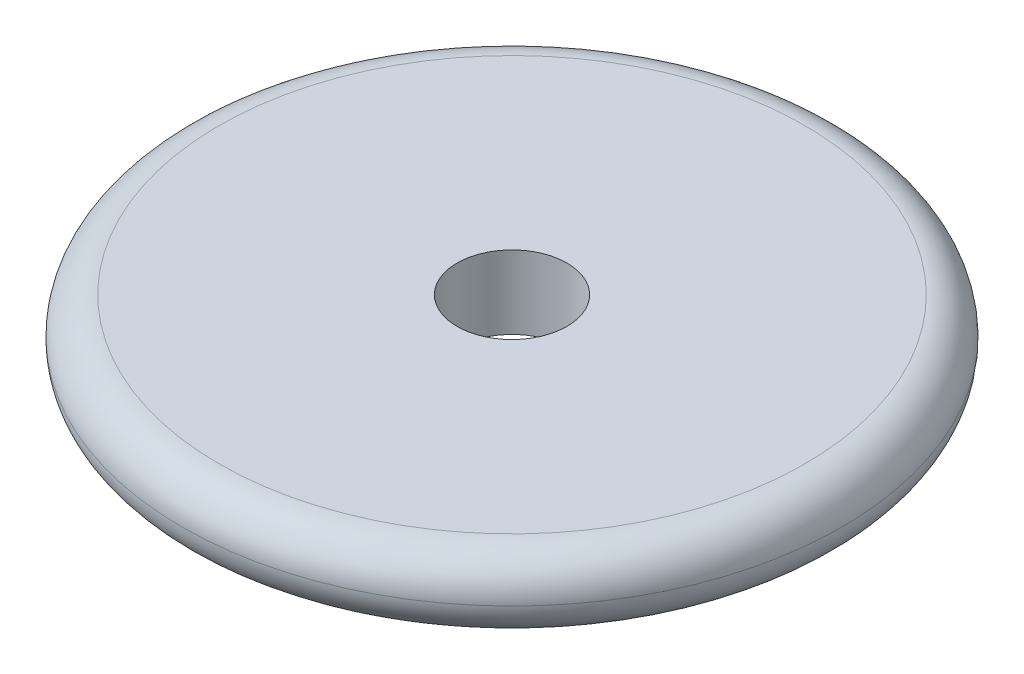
ISO-10303-21;
HEADER;
FILE_DESCRIPTION(('STEP AP214'),'2;1');
FILE_NAME('part.step','',(''),(''),'','','');
FILE_SCHEMA(('AUTOMOTIVE_DESIGN { 1 0 10303 214 1 1 1 1 }'));
ENDSEC;
DATA;
#1=APPLICATION_CONTEXT('core data for automotive mechanical design processes');
#2=APPLICATION_PROTOCOL_DEFINITION('international standard','automotive_design',2000,#1);
#3=PRODUCT_CONTEXT('',#1,'mechanical');
#4=PRODUCT('Part','Part','',(#3));
#5=PRODUCT_RELATED_PRODUCT_CATEGORY('part','',(#4));
#6=PRODUCT_DEFINITION_FORMATION('','',#4);
#7=PRODUCT_DEFINITION_CONTEXT('part definition',#1,'design');
#8=PRODUCT_DEFINITION('design','',#6,#7);
#9=PRODUCT_DEFINITION_SHAPE('','',#8);
#10=(LENGTH_UNIT() NAMED_UNIT(*) SI_UNIT(.MILLI.,.METRE.));
#11=(NAMED_UNIT(*) PLANE_ANGLE_UNIT() SI_UNIT($,.RADIAN.));
#12=(NAMED_UNIT(*) SI_UNIT($,.STERADIAN.) SOLID_ANGLE_UNIT());
#13=UNCERTAINTY_MEASURE_WITH_UNIT(LENGTH_MEASURE(1.E-05),#10,'distance_accuracy_value','');
#14=(GEOMETRIC_REPRESENTATION_CONTEXT(3) GLOBAL_UNCERTAINTY_ASSIGNED_CONTEXT((#13)) GLOBAL_UNIT_ASSIGNED_CONTEXT((#10,
#11,#12)) REPRESENTATION_CONTEXT('',''));
#15=CARTESIAN_POINT('',(0.,0.,0.));
#16=DIRECTION('',(0.,0.,1.));
#17=DIRECTION('',(1.,0.,0.));
#18=AXIS2_PLACEMENT_3D('',#15,#16,#17);
#19=CARTESIAN_POINT('',(0.,4.,0.));
#20=DIRECTION('',(0.,1.,0.));
#21=DIRECTION('',(0.,0.,1.));
#22=AXIS2_PLACEMENT_3D('',#19,#20,#21);
#23=PLANE('',#22);
#24=CARTESIAN_POINT('',(0.,4.,0.));
#25=DIRECTION('',(0.,-1.,0.));
#26=DIRECTION('',(0.,0.,-1.));
#27=AXIS2_PLACEMENT_3D('',#24,#25,#26);
#28=CIRCLE('',#27,3.);
#29=CARTESIAN_POINT('',(0.,4.,-3.));
#30=VERTEX_POINT('',#29);
#31=EDGE_CURVE('E59',#30,#30,#28,.T.);
#32=ORIENTED_EDGE('',*,*,#31,.T.);
#33=EDGE_LOOP('',(#32));
#34=FACE_BOUND('',#33,.T.);
#35=CARTESIAN_POINT('',(0.,4.,0.));
#36=DIRECTION('',(0.,1.,0.));
#37=DIRECTION('',(0.,0.,1.));
#38=AXIS2_PLACEMENT_3D('',#35,#36,#37);
#39=CIRCLE('',#38,16.);
#40=CARTESIAN_POINT('',(0.,4.,16.));
#41=VERTEX_POINT('',#40);
#42=EDGE_CURVE('E12',#41,#41,#39,.T.);
#43=ORIENTED_EDGE('',*,*,#42,.T.);
#44=EDGE_LOOP('',(#43));
#45=FACE_BOUND('',#44,.T.);
#46=ADVANCED_FACE('F42',(#34,#45),#23,.T.);
#47=CARTESIAN_POINT('',(0.,0.,0.));
#48=DIRECTION('',(0.,1.,0.));
#49=DIRECTION('',(0.,0.,1.));
#50=AXIS2_PLACEMENT_3D('',#47,#48,#49);
#51=PLANE('',#50);
#52=CARTESIAN_POINT('',(0.,0.,0.));
#53=DIRECTION('',(0.,-1.,0.));
#54=DIRECTION('',(0.,0.,-1.));
#55=AXIS2_PLACEMENT_3D('',#52,#53,#54);
#56=CIRCLE('',#55,3.);
#57=CARTESIAN_POINT('',(0.,0.,-3.));
#58=VERTEX_POINT('',#57);
#59=EDGE_CURVE('E56',#58,#58,#56,.T.);
#60=ORIENTED_EDGE('',*,*,#59,.F.);
#61=EDGE_LOOP('',(#60));
#62=FACE_BOUND('',#61,.T.);
#63=CARTESIAN_POINT('',(0.,0.,0.));
#64=DIRECTION('',(0.,1.,0.));
#65=DIRECTION('',(0.,0.,1.));
#66=AXIS2_PLACEMENT_3D('',#63,#64,#65);
#67=CIRCLE('',#66,16.);
#68=CARTESIAN_POINT('',(0.,0.,16.));
#69=VERTEX_POINT('',#68);
#70=EDGE_CURVE('E50',#69,#69,#67,.F.);
#71=ORIENTED_EDGE('',*,*,#70,.T.);
#72=EDGE_LOOP('',(#71));
#73=FACE_BOUND('',#72,.T.);
#74=ADVANCED_FACE('F69',(#62,#73),#51,.F.);
#75=CARTESIAN_POINT('',(0.,2.,0.));
#76=DIRECTION('',(0.,1.,0.));
#77=DIRECTION('',(0.,0.,1.));
#78=AXIS2_PLACEMENT_3D('',#75,#76,#77);
#79=TOROIDAL_SURFACE('',#78,16.,2.);
#80=ORIENTED_EDGE('',*,*,#42,.F.);
#81=EDGE_LOOP('',(#80));
#82=FACE_BOUND('',#81,.T.);
#83=CARTESIAN_POINT('',(0.,2.,0.));
#84=DIRECTION('',(0.,1.,0.));
#85=DIRECTION('',(0.,0.,1.));
#86=AXIS2_PLACEMENT_3D('',#83,#84,#85);
#87=CIRCLE('',#86,18.);
#88=CARTESIAN_POINT('',(0.,2.,18.));
#89=VERTEX_POINT('',#88);
#90=EDGE_CURVE('E46',#89,#89,#87,.F.);
#91=ORIENTED_EDGE('',*,*,#90,.F.);
#92=EDGE_LOOP('',(#91));
#93=FACE_BOUND('',#92,.T.);
#94=ADVANCED_FACE('F44',(#82,#93),#79,.T.);
#95=CARTESIAN_POINT('',(0.,2.,0.));
#96=DIRECTION('',(0.,1.,0.));
#97=DIRECTION('',(0.,0.,1.));
#98=AXIS2_PLACEMENT_3D('',#95,#96,#97);
#99=TOROIDAL_SURFACE('',#98,16.,2.);
#100=ORIENTED_EDGE('',*,*,#70,.F.);
#101=EDGE_LOOP('',(#100));
#102=FACE_BOUND('',#101,.T.);
#103=ORIENTED_EDGE('',*,*,#90,.T.);
#104=EDGE_LOOP('',(#103));
#105=FACE_BOUND('',#104,.T.);
#106=ADVANCED_FACE('F66',(#102,#105),#99,.T.);
#107=CARTESIAN_POINT('',(0.,4.,0.));
#108=DIRECTION('',(0.,-1.,0.));
#109=DIRECTION('',(0.,0.,-1.));
#110=AXIS2_PLACEMENT_3D('',#107,#108,#109);
#111=CYLINDRICAL_SURFACE('',#110,3.);
#112=ORIENTED_EDGE('',*,*,#31,.F.);
#113=EDGE_LOOP('',(#112));
#114=FACE_BOUND('',#113,.T.);
#115=ORIENTED_EDGE('',*,*,#59,.T.);
#116=EDGE_LOOP('',(#115));
#117=FACE_BOUND('',#116,.T.);
#118=ADVANCED_FACE('F75',(#114,#117),#111,.F.);
#119=CLOSED_SHELL('',(#46,#74,#94,#106,#118));
#120=MANIFOLD_SOLID_BREP('B2',#119);
#121=ADVANCED_BREP_SHAPE_REPRESENTATION('',(#18,#120),#14);
#122=SHAPE_DEFINITION_REPRESENTATION(#9,#121);
ENDSEC;
END-ISO-10303-21;
